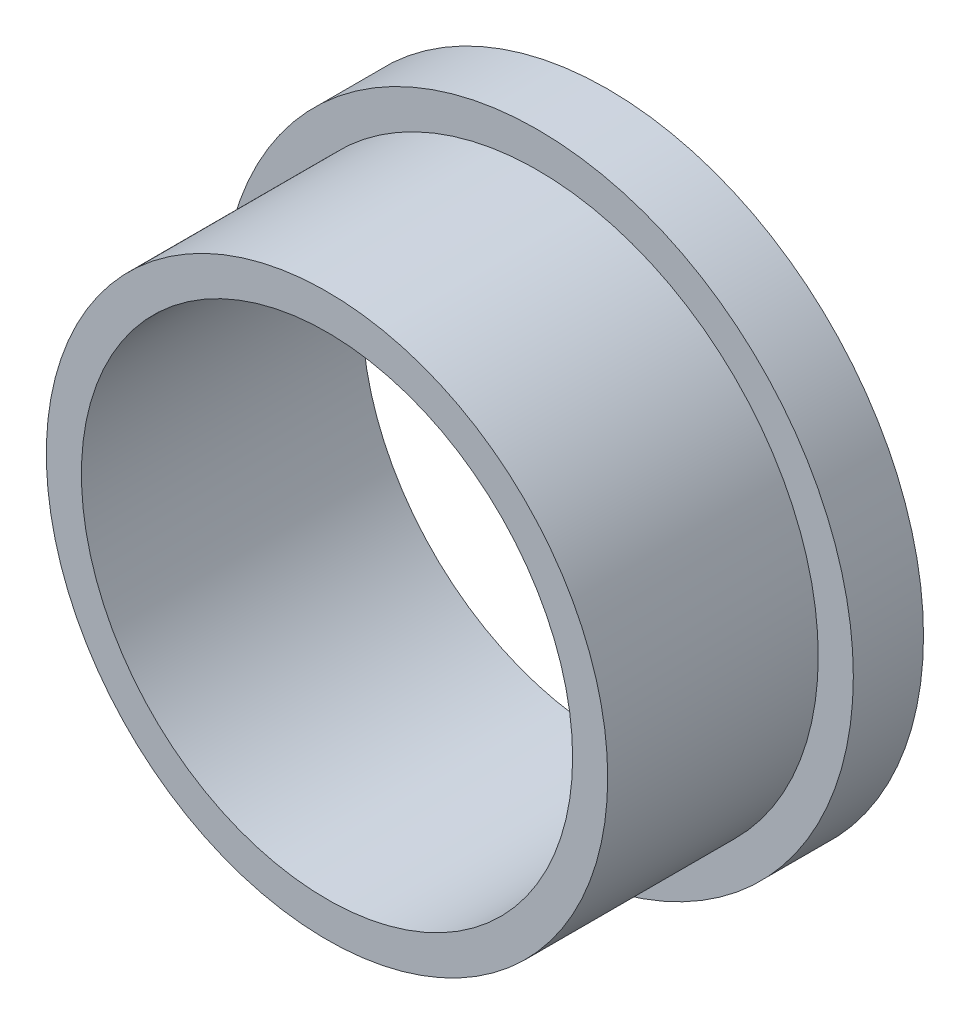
from build123d import *

# Parameters (mm, degrees)
ESQUISSE1_R             = 4.5
EXTRUSION1_DEPTH        = 1
ESQUISSE2_R             = 4
EXTRUSION2_DEPTH        = 3
ESQUISSE3_R             = 3.5
ENL_V_MAT_EXTRU_1_DEPTH = 8.516648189


with BuildPart() as part:
    # Esquisse1 → Extrusion1 (new body)
    with BuildSketch(Plane.XY):
        Circle(ESQUISSE1_R)
    extrude(amount=EXTRUSION1_DEPTH)

    # Esquisse2 → Extrusion2 (add)
    with BuildSketch(Plane.XY.offset(1)):
        Circle(ESQUISSE2_R)
    extrude(amount=EXTRUSION2_DEPTH)

    # Esquisse3 → Enl_v. mat.-Extru.1 (cut, through all)
    with BuildSketch(Plane.XY.offset(4)):
        Circle(ESQUISSE3_R)
    extrude(amount=-ENL_V_MAT_EXTRU_1_DEPTH, mode=Mode.SUBTRACT)


solid = part.part
